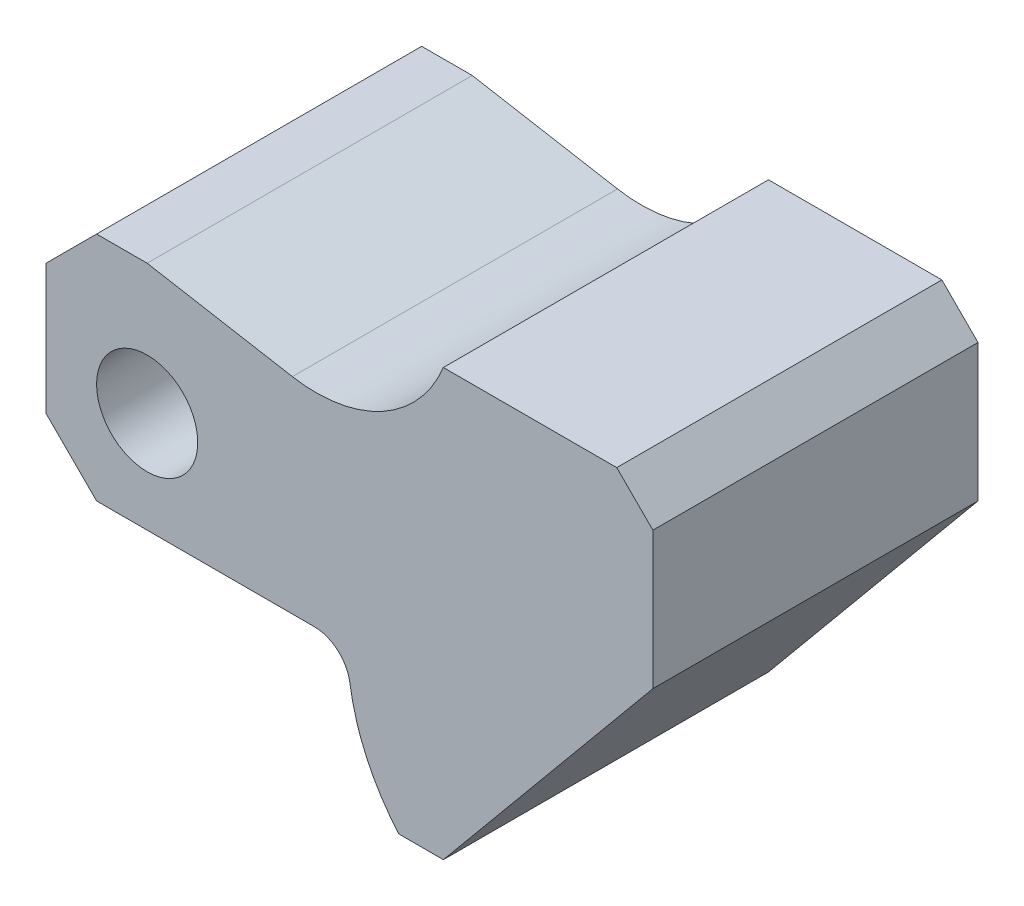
from build123d import *

# Parameters (mm, degrees)
ESQUISSE1_R        = 7
BOSS_EXTRU_1_DEPTH = 45


with BuildPart() as part:
    # Esquisse1 → Boss.-Extru.1 (new body)
    with BuildSketch(Plane.XY):
        with BuildLine():
            Line((-8.882344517, 17.689785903), (15.117655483, 17.689785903))
            Line((15.117655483, 17.689785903), (20.117655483, 12.689785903))
            Line((20.117655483, 12.689785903), (20.117655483, -6.310214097))
            Line((20.117655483, -6.310214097), (-8.882344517, -41.310214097))
            Line((-8.882344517, -41.310214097), (-15.048389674, -41.310214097))
            ThreePointArc((-15.048389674, -41.310214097), (-19.487361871, -34.425886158), (-21.824192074, -26.574919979))
            ThreePointArc((-21.824192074, -26.574919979), (-23.504595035, -23.523627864), (-26.769830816, -22.310214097))
            Line((-26.769830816, -22.310214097), (-56.882344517, -22.310214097))
            Line((-56.882344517, -22.310214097), (-63.882344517, -15.310214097))
            Line((-63.882344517, -15.310214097), (-63.882344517, 2.689785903))
            Line((-63.882344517, 2.689785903), (-56.882344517, 9.689785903))
            Line((-56.882344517, 9.689785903), (-49.882344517, 9.689785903))
            Line((-49.882344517, 9.689785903), (-29.778302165, 6.144900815))
            ThreePointArc((-29.778302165, 6.144900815), (-17.290707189, 8.225688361), (-8.882344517, 17.689785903))
        make_face()
        with Locations(Location((-49.882344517, -8.310214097, 0), (0, 0, 180))):
            Circle(ESQUISSE1_R, mode=Mode.SUBTRACT)
    extrude(amount=BOSS_EXTRU_1_DEPTH)


solid = part.part
